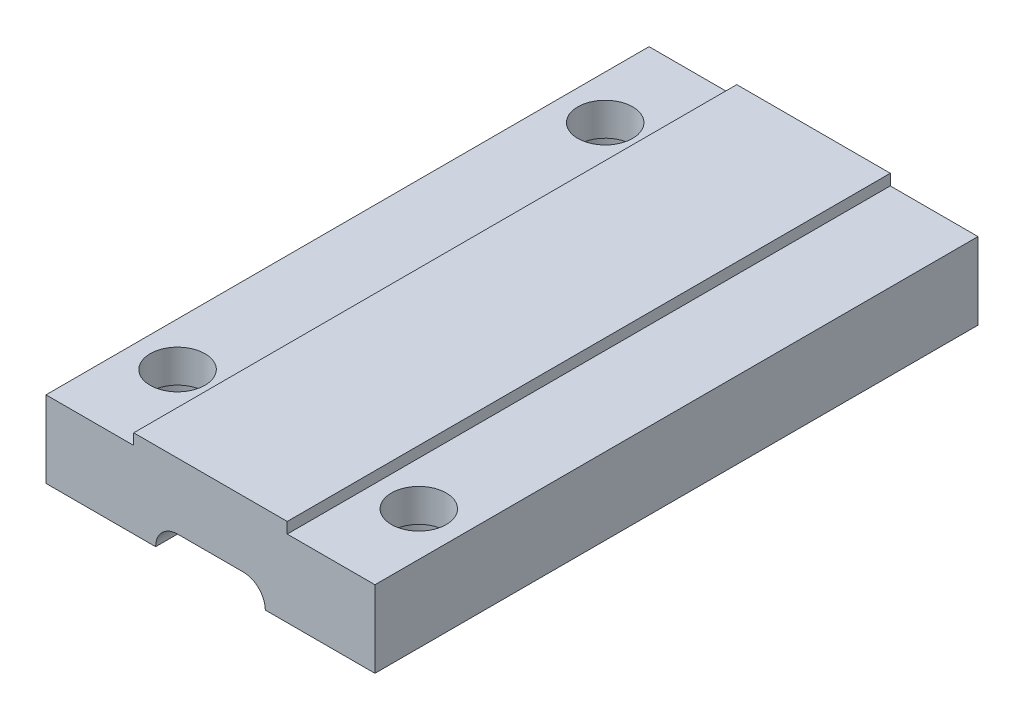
ISO-10303-21;
HEADER;
FILE_DESCRIPTION(('STEP AP214'),'2;1');
FILE_NAME('part.step','',(''),(''),'','','');
FILE_SCHEMA(('AUTOMOTIVE_DESIGN { 1 0 10303 214 1 1 1 1 }'));
ENDSEC;
DATA;
#1=APPLICATION_CONTEXT('core data for automotive mechanical design processes');
#2=APPLICATION_PROTOCOL_DEFINITION('international standard','automotive_design',2000,#1);
#3=PRODUCT_CONTEXT('',#1,'mechanical');
#4=PRODUCT('Part','Part','',(#3));
#5=PRODUCT_RELATED_PRODUCT_CATEGORY('part','',(#4));
#6=PRODUCT_DEFINITION_FORMATION('','',#4);
#7=PRODUCT_DEFINITION_CONTEXT('part definition',#1,'design');
#8=PRODUCT_DEFINITION('design','',#6,#7);
#9=PRODUCT_DEFINITION_SHAPE('','',#8);
#10=(LENGTH_UNIT() NAMED_UNIT(*) SI_UNIT(.MILLI.,.METRE.));
#11=(NAMED_UNIT(*) PLANE_ANGLE_UNIT() SI_UNIT($,.RADIAN.));
#12=(NAMED_UNIT(*) SI_UNIT($,.STERADIAN.) SOLID_ANGLE_UNIT());
#13=UNCERTAINTY_MEASURE_WITH_UNIT(LENGTH_MEASURE(1.E-05),#10,'distance_accuracy_value','');
#14=(GEOMETRIC_REPRESENTATION_CONTEXT(3) GLOBAL_UNCERTAINTY_ASSIGNED_CONTEXT((#13)) GLOBAL_UNIT_ASSIGNED_CONTEXT((#10,
#11,#12)) REPRESENTATION_CONTEXT('',''));
#15=CARTESIAN_POINT('',(0.,0.,0.));
#16=DIRECTION('',(0.,0.,1.));
#17=DIRECTION('',(1.,0.,0.));
#18=AXIS2_PLACEMENT_3D('',#15,#16,#17);
#19=CARTESIAN_POINT('',(0.,0.,110.));
#20=DIRECTION('',(1.,0.,0.));
#21=DIRECTION('',(0.,0.,-1.));
#22=AXIS2_PLACEMENT_3D('',#19,#20,#21);
#23=PLANE('',#22);
#24=DIRECTION('',(0.,-1.,0.));
#25=VECTOR('',#24,1.);
#26=CARTESIAN_POINT('',(0.,0.,0.));
#27=LINE('',#26,#25);
#28=CARTESIAN_POINT('',(0.,14.,0.));
#29=VERTEX_POINT('',#28);
#30=CARTESIAN_POINT('',(0.,0.,0.));
#31=VERTEX_POINT('',#30);
#32=EDGE_CURVE('E127',#29,#31,#27,.T.);
#33=ORIENTED_EDGE('',*,*,#32,.T.);
#34=DIRECTION('',(0.,0.,-1.));
#35=VECTOR('',#34,1.);
#36=CARTESIAN_POINT('',(0.,0.,110.));
#37=LINE('',#36,#35);
#38=CARTESIAN_POINT('',(0.,0.,110.));
#39=VERTEX_POINT('',#38);
#40=EDGE_CURVE('E134',#39,#31,#37,.T.);
#41=ORIENTED_EDGE('',*,*,#40,.F.);
#42=DIRECTION('',(0.,-1.,0.));
#43=VECTOR('',#42,1.);
#44=CARTESIAN_POINT('',(0.,0.,110.));
#45=LINE('',#44,#43);
#46=CARTESIAN_POINT('',(0.,14.,110.));
#47=VERTEX_POINT('',#46);
#48=EDGE_CURVE('E169',#47,#39,#45,.T.);
#49=ORIENTED_EDGE('',*,*,#48,.F.);
#50=DIRECTION('',(0.,0.,-1.));
#51=VECTOR('',#50,1.);
#52=CARTESIAN_POINT('',(0.,14.,110.));
#53=LINE('',#52,#51);
#54=EDGE_CURVE('E145',#47,#29,#53,.T.);
#55=ORIENTED_EDGE('',*,*,#54,.T.);
#56=EDGE_LOOP('',(#33,#41,#49,#55));
#57=FACE_BOUND('',#56,.T.);
#58=ADVANCED_FACE('F34',(#57),#23,.F.);
#59=CARTESIAN_POINT('',(0.,0.,110.));
#60=DIRECTION('',(0.,1.,0.));
#61=DIRECTION('',(0.,0.,1.));
#62=AXIS2_PLACEMENT_3D('',#59,#60,#61);
#63=PLANE('',#62);
#64=CARTESIAN_POINT('',(8.,0.,16.));
#65=DIRECTION('',(0.,-1.,0.));
#66=DIRECTION('',(0.,0.,-1.));
#67=AXIS2_PLACEMENT_3D('',#64,#65,#66);
#68=CIRCLE('',#67,7.00000000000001);
#69=CARTESIAN_POINT('',(8.,0.,8.99999999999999));
#70=VERTEX_POINT('',#69);
#71=EDGE_CURVE('E481',#70,#70,#68,.T.);
#72=ORIENTED_EDGE('',*,*,#71,.F.);
#73=EDGE_LOOP('',(#72));
#74=FACE_BOUND('',#73,.T.);
#75=CARTESIAN_POINT('',(8.00000000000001,0.,94.));
#76=DIRECTION('',(0.,-1.,0.));
#77=DIRECTION('',(0.,0.,-1.));
#78=AXIS2_PLACEMENT_3D('',#75,#76,#77);
#79=CIRCLE('',#78,7.00000000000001);
#80=CARTESIAN_POINT('',(8.00000000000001,0.,87.));
#81=VERTEX_POINT('',#80);
#82=EDGE_CURVE('E223',#81,#81,#79,.T.);
#83=ORIENTED_EDGE('',*,*,#82,.F.);
#84=EDGE_LOOP('',(#83));
#85=FACE_BOUND('',#84,.T.);
#86=DIRECTION('',(1.,0.,0.));
#87=VECTOR('',#86,1.);
#88=CARTESIAN_POINT('',(0.,0.,0.));
#89=LINE('',#88,#87);
#90=CARTESIAN_POINT('',(20.,0.,0.));
#91=VERTEX_POINT('',#90);
#92=EDGE_CURVE('E122',#31,#91,#89,.T.);
#93=ORIENTED_EDGE('',*,*,#92,.T.);
#94=DIRECTION('',(0.,0.,-1.));
#95=VECTOR('',#94,1.);
#96=CARTESIAN_POINT('',(20.,0.,110.));
#97=LINE('',#96,#95);
#98=CARTESIAN_POINT('',(20.,0.,110.));
#99=VERTEX_POINT('',#98);
#100=EDGE_CURVE('E141',#99,#91,#97,.T.);
#101=ORIENTED_EDGE('',*,*,#100,.F.);
#102=DIRECTION('',(1.,0.,0.));
#103=VECTOR('',#102,1.);
#104=CARTESIAN_POINT('',(0.,0.,110.));
#105=LINE('',#104,#103);
#106=EDGE_CURVE('E136',#39,#99,#105,.T.);
#107=ORIENTED_EDGE('',*,*,#106,.F.);
#108=ORIENTED_EDGE('',*,*,#40,.T.);
#109=EDGE_LOOP('',(#93,#101,#107,#108));
#110=FACE_BOUND('',#109,.T.);
#111=ADVANCED_FACE('F135',(#74,#85,#110),#63,.F.);
#112=CARTESIAN_POINT('',(20.,4.,110.));
#113=DIRECTION('',(0.,1.,0.));
#114=DIRECTION('',(0.,0.,1.));
#115=AXIS2_PLACEMENT_3D('',#112,#113,#114);
#116=PLANE('',#115);
#117=DIRECTION('',(1.,0.,0.));
#118=VECTOR('',#117,1.);
#119=CARTESIAN_POINT('',(20.,4.,110.));
#120=LINE('',#119,#118);
#121=CARTESIAN_POINT('',(24.,4.,110.));
#122=VERTEX_POINT('',#121);
#123=CARTESIAN_POINT('',(36.,4.,110.));
#124=VERTEX_POINT('',#123);
#125=EDGE_CURVE('E172',#122,#124,#120,.T.);
#126=ORIENTED_EDGE('',*,*,#125,.F.);
#127=DIRECTION('',(0.,0.,-1.));
#128=VECTOR('',#127,1.);
#129=CARTESIAN_POINT('',(24.,4.,0.));
#130=LINE('',#129,#128);
#131=CARTESIAN_POINT('',(24.,4.,0.));
#132=VERTEX_POINT('',#131);
#133=EDGE_CURVE('E218',#122,#132,#130,.T.);
#134=ORIENTED_EDGE('',*,*,#133,.T.);
#135=DIRECTION('',(1.,0.,0.));
#136=VECTOR('',#135,1.);
#137=CARTESIAN_POINT('',(20.,4.,0.));
#138=LINE('',#137,#136);
#139=CARTESIAN_POINT('',(36.,4.,0.));
#140=VERTEX_POINT('',#139);
#141=EDGE_CURVE('E131',#132,#140,#138,.T.);
#142=ORIENTED_EDGE('',*,*,#141,.T.);
#143=DIRECTION('',(0.,0.,-1.));
#144=VECTOR('',#143,1.);
#145=CARTESIAN_POINT('',(36.,4.,110.));
#146=LINE('',#145,#144);
#147=EDGE_CURVE('E140',#140,#124,#146,.F.);
#148=ORIENTED_EDGE('',*,*,#147,.T.);
#149=EDGE_LOOP('',(#126,#134,#142,#148));
#150=FACE_BOUND('',#149,.T.);
#151=ADVANCED_FACE('F250',(#150),#116,.F.);
#152=CARTESIAN_POINT('',(40.,0.,110.));
#153=DIRECTION('',(0.,1.,0.));
#154=DIRECTION('',(0.,0.,1.));
#155=AXIS2_PLACEMENT_3D('',#152,#153,#154);
#156=PLANE('',#155);
#157=CARTESIAN_POINT('',(52.,0.,94.));
#158=DIRECTION('',(0.,-1.,0.));
#159=DIRECTION('',(0.,0.,-1.));
#160=AXIS2_PLACEMENT_3D('',#157,#158,#159);
#161=CIRCLE('',#160,7.00000000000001);
#162=CARTESIAN_POINT('',(52.,0.,87.));
#163=VERTEX_POINT('',#162);
#164=EDGE_CURVE('E149',#163,#163,#161,.T.);
#165=ORIENTED_EDGE('',*,*,#164,.F.);
#166=EDGE_LOOP('',(#165));
#167=FACE_BOUND('',#166,.T.);
#168=DIRECTION('',(1.,0.,0.));
#169=VECTOR('',#168,1.);
#170=CARTESIAN_POINT('',(40.,0.,0.));
#171=LINE('',#170,#169);
#172=CARTESIAN_POINT('',(40.,0.,0.));
#173=VERTEX_POINT('',#172);
#174=CARTESIAN_POINT('',(60.,0.,0.));
#175=VERTEX_POINT('',#174);
#176=EDGE_CURVE('E155',#173,#175,#171,.T.);
#177=ORIENTED_EDGE('',*,*,#176,.T.);
#178=DIRECTION('',(0.,0.,-1.));
#179=VECTOR('',#178,1.);
#180=CARTESIAN_POINT('',(60.,0.,110.));
#181=LINE('',#180,#179);
#182=CARTESIAN_POINT('',(60.,0.,110.));
#183=VERTEX_POINT('',#182);
#184=EDGE_CURVE('E204',#183,#175,#181,.T.);
#185=ORIENTED_EDGE('',*,*,#184,.F.);
#186=DIRECTION('',(1.,0.,0.));
#187=VECTOR('',#186,1.);
#188=CARTESIAN_POINT('',(40.,0.,110.));
#189=LINE('',#188,#187);
#190=CARTESIAN_POINT('',(40.,0.,110.));
#191=VERTEX_POINT('',#190);
#192=EDGE_CURVE('E174',#191,#183,#189,.T.);
#193=ORIENTED_EDGE('',*,*,#192,.F.);
#194=DIRECTION('',(0.,0.,-1.));
#195=VECTOR('',#194,1.);
#196=CARTESIAN_POINT('',(40.,0.,110.));
#197=LINE('',#196,#195);
#198=EDGE_CURVE('E207',#191,#173,#197,.T.);
#199=ORIENTED_EDGE('',*,*,#198,.T.);
#200=EDGE_LOOP('',(#177,#185,#193,#199));
#201=FACE_BOUND('',#200,.T.);
#202=ADVANCED_FACE('F246',(#167,#201),#156,.F.);
#203=CARTESIAN_POINT('',(60.,0.,110.));
#204=DIRECTION('',(-1.,0.,0.));
#205=DIRECTION('',(0.,0.,1.));
#206=AXIS2_PLACEMENT_3D('',#203,#204,#205);
#207=PLANE('',#206);
#208=DIRECTION('',(0.,1.,0.));
#209=VECTOR('',#208,1.);
#210=CARTESIAN_POINT('',(60.,0.,0.));
#211=LINE('',#210,#209);
#212=CARTESIAN_POINT('',(60.,14.,0.));
#213=VERTEX_POINT('',#212);
#214=EDGE_CURVE('E157',#175,#213,#211,.T.);
#215=ORIENTED_EDGE('',*,*,#214,.T.);
#216=DIRECTION('',(0.,0.,-1.));
#217=VECTOR('',#216,1.);
#218=CARTESIAN_POINT('',(60.,14.,110.));
#219=LINE('',#218,#217);
#220=CARTESIAN_POINT('',(60.,14.,110.));
#221=VERTEX_POINT('',#220);
#222=EDGE_CURVE('E201',#221,#213,#219,.T.);
#223=ORIENTED_EDGE('',*,*,#222,.F.);
#224=DIRECTION('',(0.,1.,0.));
#225=VECTOR('',#224,1.);
#226=CARTESIAN_POINT('',(60.,0.,110.));
#227=LINE('',#226,#225);
#228=EDGE_CURVE('E176',#183,#221,#227,.T.);
#229=ORIENTED_EDGE('',*,*,#228,.F.);
#230=ORIENTED_EDGE('',*,*,#184,.T.);
#231=EDGE_LOOP('',(#215,#223,#229,#230));
#232=FACE_BOUND('',#231,.T.);
#233=ADVANCED_FACE('F249',(#232),#207,.F.);
#234=CARTESIAN_POINT('',(44.,14.,110.));
#235=DIRECTION('',(0.,-1.,0.));
#236=DIRECTION('',(0.,0.,-1.));
#237=AXIS2_PLACEMENT_3D('',#234,#235,#236);
#238=PLANE('',#237);
#239=CARTESIAN_POINT('',(52.,14.,94.));
#240=DIRECTION('',(0.,-1.,0.));
#241=DIRECTION('',(0.,0.,-1.));
#242=AXIS2_PLACEMENT_3D('',#239,#240,#241);
#243=CIRCLE('',#242,5.00000000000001);
#244=CARTESIAN_POINT('',(52.,14.,89.));
#245=VERTEX_POINT('',#244);
#246=EDGE_CURVE('E146',#245,#245,#243,.T.);
#247=ORIENTED_EDGE('',*,*,#246,.T.);
#248=EDGE_LOOP('',(#247));
#249=FACE_BOUND('',#248,.T.);
#250=DIRECTION('',(-1.,0.,0.));
#251=VECTOR('',#250,1.);
#252=CARTESIAN_POINT('',(44.,14.,0.));
#253=LINE('',#252,#251);
#254=CARTESIAN_POINT('',(44.,14.,0.));
#255=VERTEX_POINT('',#254);
#256=EDGE_CURVE('E159',#213,#255,#253,.T.);
#257=ORIENTED_EDGE('',*,*,#256,.T.);
#258=DIRECTION('',(0.,0.,-1.));
#259=VECTOR('',#258,1.);
#260=CARTESIAN_POINT('',(44.,14.,110.));
#261=LINE('',#260,#259);
#262=CARTESIAN_POINT('',(44.,14.,110.));
#263=VERTEX_POINT('',#262);
#264=EDGE_CURVE('E198',#263,#255,#261,.T.);
#265=ORIENTED_EDGE('',*,*,#264,.F.);
#266=DIRECTION('',(-1.,0.,0.));
#267=VECTOR('',#266,1.);
#268=CARTESIAN_POINT('',(44.,14.,110.));
#269=LINE('',#268,#267);
#270=EDGE_CURVE('E178',#221,#263,#269,.T.);
#271=ORIENTED_EDGE('',*,*,#270,.F.);
#272=ORIENTED_EDGE('',*,*,#222,.T.);
#273=EDGE_LOOP('',(#257,#265,#271,#272));
#274=FACE_BOUND('',#273,.T.);
#275=ADVANCED_FACE('F265',(#249,#274),#238,.F.);
#276=CARTESIAN_POINT('',(44.,16.,110.));
#277=DIRECTION('',(-1.,0.,0.));
#278=DIRECTION('',(0.,0.,1.));
#279=AXIS2_PLACEMENT_3D('',#276,#277,#278);
#280=PLANE('',#279);
#281=DIRECTION('',(0.,1.,0.));
#282=VECTOR('',#281,1.);
#283=CARTESIAN_POINT('',(44.,16.,0.));
#284=LINE('',#283,#282);
#285=CARTESIAN_POINT('',(44.,16.,0.));
#286=VERTEX_POINT('',#285);
#287=EDGE_CURVE('E161',#255,#286,#284,.T.);
#288=ORIENTED_EDGE('',*,*,#287,.T.);
#289=DIRECTION('',(0.,0.,-1.));
#290=VECTOR('',#289,1.);
#291=CARTESIAN_POINT('',(44.,16.,110.));
#292=LINE('',#291,#290);
#293=CARTESIAN_POINT('',(44.,16.,110.));
#294=VERTEX_POINT('',#293);
#295=EDGE_CURVE('E195',#294,#286,#292,.T.);
#296=ORIENTED_EDGE('',*,*,#295,.F.);
#297=DIRECTION('',(0.,1.,0.));
#298=VECTOR('',#297,1.);
#299=CARTESIAN_POINT('',(44.,16.,110.));
#300=LINE('',#299,#298);
#301=EDGE_CURVE('E180',#263,#294,#300,.T.);
#302=ORIENTED_EDGE('',*,*,#301,.F.);
#303=ORIENTED_EDGE('',*,*,#264,.T.);
#304=EDGE_LOOP('',(#288,#296,#302,#303));
#305=FACE_BOUND('',#304,.T.);
#306=ADVANCED_FACE('F269',(#305),#280,.F.);
#307=CARTESIAN_POINT('',(16.,16.,110.));
#308=DIRECTION('',(0.,-1.,0.));
#309=DIRECTION('',(0.,0.,-1.));
#310=AXIS2_PLACEMENT_3D('',#307,#308,#309);
#311=PLANE('',#310);
#312=DIRECTION('',(-1.,0.,0.));
#313=VECTOR('',#312,1.);
#314=CARTESIAN_POINT('',(16.,16.,0.));
#315=LINE('',#314,#313);
#316=CARTESIAN_POINT('',(16.,16.,0.));
#317=VERTEX_POINT('',#316);
#318=EDGE_CURVE('E163',#286,#317,#315,.T.);
#319=ORIENTED_EDGE('',*,*,#318,.T.);
#320=DIRECTION('',(0.,0.,-1.));
#321=VECTOR('',#320,1.);
#322=CARTESIAN_POINT('',(16.,16.,110.));
#323=LINE('',#322,#321);
#324=CARTESIAN_POINT('',(16.,16.,110.));
#325=VERTEX_POINT('',#324);
#326=EDGE_CURVE('E192',#325,#317,#323,.T.);
#327=ORIENTED_EDGE('',*,*,#326,.F.);
#328=DIRECTION('',(-1.,0.,0.));
#329=VECTOR('',#328,1.);
#330=CARTESIAN_POINT('',(16.,16.,110.));
#331=LINE('',#330,#329);
#332=EDGE_CURVE('E182',#294,#325,#331,.T.);
#333=ORIENTED_EDGE('',*,*,#332,.F.);
#334=ORIENTED_EDGE('',*,*,#295,.T.);
#335=EDGE_LOOP('',(#319,#327,#333,#334));
#336=FACE_BOUND('',#335,.T.);
#337=ADVANCED_FACE('F310',(#336),#311,.F.);
#338=CARTESIAN_POINT('',(16.,14.,110.));
#339=DIRECTION('',(1.,0.,0.));
#340=DIRECTION('',(0.,0.,-1.));
#341=AXIS2_PLACEMENT_3D('',#338,#339,#340);
#342=PLANE('',#341);
#343=DIRECTION('',(0.,-1.,0.));
#344=VECTOR('',#343,1.);
#345=CARTESIAN_POINT('',(16.,14.,0.));
#346=LINE('',#345,#344);
#347=CARTESIAN_POINT('',(16.,14.,0.));
#348=VERTEX_POINT('',#347);
#349=EDGE_CURVE('E165',#317,#348,#346,.T.);
#350=ORIENTED_EDGE('',*,*,#349,.T.);
#351=DIRECTION('',(0.,0.,-1.));
#352=VECTOR('',#351,1.);
#353=CARTESIAN_POINT('',(16.,14.,110.));
#354=LINE('',#353,#352);
#355=CARTESIAN_POINT('',(16.,14.,110.));
#356=VERTEX_POINT('',#355);
#357=EDGE_CURVE('E189',#356,#348,#354,.T.);
#358=ORIENTED_EDGE('',*,*,#357,.F.);
#359=DIRECTION('',(0.,-1.,0.));
#360=VECTOR('',#359,1.);
#361=CARTESIAN_POINT('',(16.,14.,110.));
#362=LINE('',#361,#360);
#363=EDGE_CURVE('E184',#325,#356,#362,.T.);
#364=ORIENTED_EDGE('',*,*,#363,.F.);
#365=ORIENTED_EDGE('',*,*,#326,.T.);
#366=EDGE_LOOP('',(#350,#358,#364,#365));
#367=FACE_BOUND('',#366,.T.);
#368=ADVANCED_FACE('F313',(#367),#342,.F.);
#369=CARTESIAN_POINT('',(0.,14.,110.));
#370=DIRECTION('',(0.,-1.,0.));
#371=DIRECTION('',(0.,0.,-1.));
#372=AXIS2_PLACEMENT_3D('',#369,#370,#371);
#373=PLANE('',#372);
#374=CARTESIAN_POINT('',(8.,14.,16.));
#375=DIRECTION('',(0.,-1.,0.));
#376=DIRECTION('',(0.,0.,-1.));
#377=AXIS2_PLACEMENT_3D('',#374,#375,#376);
#378=CIRCLE('',#377,5.00000000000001);
#379=CARTESIAN_POINT('',(8.,14.,11.));
#380=VERTEX_POINT('',#379);
#381=EDGE_CURVE('E37',#380,#380,#378,.T.);
#382=ORIENTED_EDGE('',*,*,#381,.T.);
#383=EDGE_LOOP('',(#382));
#384=FACE_BOUND('',#383,.T.);
#385=CARTESIAN_POINT('',(8.00000000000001,14.,94.));
#386=DIRECTION('',(0.,-1.,0.));
#387=DIRECTION('',(0.,0.,-1.));
#388=AXIS2_PLACEMENT_3D('',#385,#386,#387);
#389=CIRCLE('',#388,5.00000000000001);
#390=CARTESIAN_POINT('',(8.00000000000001,14.,89.));
#391=VERTEX_POINT('',#390);
#392=EDGE_CURVE('E220',#391,#391,#389,.T.);
#393=ORIENTED_EDGE('',*,*,#392,.T.);
#394=EDGE_LOOP('',(#393));
#395=FACE_BOUND('',#394,.T.);
#396=DIRECTION('',(-1.,0.,0.));
#397=VECTOR('',#396,1.);
#398=CARTESIAN_POINT('',(0.,14.,0.));
#399=LINE('',#398,#397);
#400=EDGE_CURVE('E167',#348,#29,#399,.T.);
#401=ORIENTED_EDGE('',*,*,#400,.T.);
#402=ORIENTED_EDGE('',*,*,#54,.F.);
#403=DIRECTION('',(-1.,0.,0.));
#404=VECTOR('',#403,1.);
#405=CARTESIAN_POINT('',(0.,14.,110.));
#406=LINE('',#405,#404);
#407=EDGE_CURVE('E186',#356,#47,#406,.T.);
#408=ORIENTED_EDGE('',*,*,#407,.F.);
#409=ORIENTED_EDGE('',*,*,#357,.T.);
#410=EDGE_LOOP('',(#401,#402,#408,#409));
#411=FACE_BOUND('',#410,.T.);
#412=ADVANCED_FACE('F317',(#384,#395,#411),#373,.F.);
#413=CARTESIAN_POINT('',(0.,14.,110.));
#414=DIRECTION('',(0.,0.,-1.));
#415=DIRECTION('',(-1.,0.,0.));
#416=AXIS2_PLACEMENT_3D('',#413,#414,#415);
#417=PLANE('',#416);
#418=ORIENTED_EDGE('',*,*,#48,.T.);
#419=ORIENTED_EDGE('',*,*,#106,.T.);
#420=CARTESIAN_POINT('',(24.,0.,110.));
#421=DIRECTION('',(0.,0.,-1.));
#422=DIRECTION('',(-1.,0.,0.));
#423=AXIS2_PLACEMENT_3D('',#420,#421,#422);
#424=CIRCLE('',#423,4.);
#425=EDGE_CURVE('E11',#99,#122,#424,.T.);
#426=ORIENTED_EDGE('',*,*,#425,.T.);
#427=ORIENTED_EDGE('',*,*,#125,.T.);
#428=CARTESIAN_POINT('',(36.,0.,110.));
#429=DIRECTION('',(0.,0.,-1.));
#430=DIRECTION('',(-1.,0.,0.));
#431=AXIS2_PLACEMENT_3D('',#428,#429,#430);
#432=CIRCLE('',#431,4.);
#433=EDGE_CURVE('E216',#124,#191,#432,.T.);
#434=ORIENTED_EDGE('',*,*,#433,.T.);
#435=ORIENTED_EDGE('',*,*,#192,.T.);
#436=ORIENTED_EDGE('',*,*,#228,.T.);
#437=ORIENTED_EDGE('',*,*,#270,.T.);
#438=ORIENTED_EDGE('',*,*,#301,.T.);
#439=ORIENTED_EDGE('',*,*,#332,.T.);
#440=ORIENTED_EDGE('',*,*,#363,.T.);
#441=ORIENTED_EDGE('',*,*,#407,.T.);
#442=EDGE_LOOP('',(#418,#419,#426,#427,#434,#435,#436,#437,#438,#439,#440,#441));
#443=FACE_BOUND('',#442,.T.);
#444=ADVANCED_FACE('F272',(#443),#417,.F.);
#445=CARTESIAN_POINT('',(0.,14.,0.));
#446=DIRECTION('',(0.,0.,-1.));
#447=DIRECTION('',(-1.,0.,0.));
#448=AXIS2_PLACEMENT_3D('',#445,#446,#447);
#449=PLANE('',#448);
#450=ORIENTED_EDGE('',*,*,#32,.F.);
#451=ORIENTED_EDGE('',*,*,#400,.F.);
#452=ORIENTED_EDGE('',*,*,#349,.F.);
#453=ORIENTED_EDGE('',*,*,#318,.F.);
#454=ORIENTED_EDGE('',*,*,#287,.F.);
#455=ORIENTED_EDGE('',*,*,#256,.F.);
#456=ORIENTED_EDGE('',*,*,#214,.F.);
#457=ORIENTED_EDGE('',*,*,#176,.F.);
#458=CARTESIAN_POINT('',(36.,0.,0.));
#459=DIRECTION('',(0.,0.,-1.));
#460=DIRECTION('',(-1.,0.,0.));
#461=AXIS2_PLACEMENT_3D('',#458,#459,#460);
#462=CIRCLE('',#461,4.);
#463=EDGE_CURVE('E213',#173,#140,#462,.F.);
#464=ORIENTED_EDGE('',*,*,#463,.T.);
#465=ORIENTED_EDGE('',*,*,#141,.F.);
#466=CARTESIAN_POINT('',(24.,0.,0.));
#467=DIRECTION('',(0.,0.,-1.));
#468=DIRECTION('',(-1.,0.,0.));
#469=AXIS2_PLACEMENT_3D('',#466,#467,#468);
#470=CIRCLE('',#469,4.);
#471=EDGE_CURVE('E42',#132,#91,#470,.F.);
#472=ORIENTED_EDGE('',*,*,#471,.T.);
#473=ORIENTED_EDGE('',*,*,#92,.F.);
#474=EDGE_LOOP('',(#450,#451,#452,#453,#454,#455,#456,#457,#464,#465,#472,#473));
#475=FACE_BOUND('',#474,.T.);
#476=ADVANCED_FACE('F124',(#475),#449,.T.);
#477=CARTESIAN_POINT('',(36.,0.,110.));
#478=DIRECTION('',(0.,0.,1.));
#479=DIRECTION('',(1.,0.,0.));
#480=AXIS2_PLACEMENT_3D('',#477,#478,#479);
#481=CYLINDRICAL_SURFACE('',#480,4.);
#482=ORIENTED_EDGE('',*,*,#433,.F.);
#483=ORIENTED_EDGE('',*,*,#147,.F.);
#484=ORIENTED_EDGE('',*,*,#463,.F.);
#485=ORIENTED_EDGE('',*,*,#198,.F.);
#486=EDGE_LOOP('',(#482,#483,#484,#485));
#487=FACE_BOUND('',#486,.T.);
#488=ADVANCED_FACE('F276',(#487),#481,.F.);
#489=CARTESIAN_POINT('',(24.,0.,110.));
#490=DIRECTION('',(0.,0.,1.));
#491=DIRECTION('',(1.,0.,0.));
#492=AXIS2_PLACEMENT_3D('',#489,#490,#491);
#493=CYLINDRICAL_SURFACE('',#492,4.);
#494=ORIENTED_EDGE('',*,*,#425,.F.);
#495=ORIENTED_EDGE('',*,*,#100,.T.);
#496=ORIENTED_EDGE('',*,*,#471,.F.);
#497=ORIENTED_EDGE('',*,*,#133,.F.);
#498=EDGE_LOOP('',(#494,#495,#496,#497));
#499=FACE_BOUND('',#498,.T.);
#500=ADVANCED_FACE('F279',(#499),#493,.F.);
#501=CARTESIAN_POINT('',(52.,0.,94.));
#502=DIRECTION('',(0.,-1.,0.));
#503=DIRECTION('',(0.,0.,-1.));
#504=AXIS2_PLACEMENT_3D('',#501,#502,#503);
#505=CYLINDRICAL_SURFACE('',#504,5.00000000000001);
#506=CARTESIAN_POINT('',(52.,8.,94.));
#507=DIRECTION('',(0.,-1.,0.));
#508=DIRECTION('',(0.,0.,-1.));
#509=AXIS2_PLACEMENT_3D('',#506,#507,#508);
#510=CIRCLE('',#509,5.00000000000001);
#511=CARTESIAN_POINT('',(52.,8.,89.));
#512=VERTEX_POINT('',#511);
#513=EDGE_CURVE('E222',#512,#512,#510,.T.);
#514=ORIENTED_EDGE('',*,*,#513,.T.);
#515=EDGE_LOOP('',(#514));
#516=FACE_BOUND('',#515,.T.);
#517=ORIENTED_EDGE('',*,*,#246,.F.);
#518=EDGE_LOOP('',(#517));
#519=FACE_BOUND('',#518,.T.);
#520=ADVANCED_FACE('F281',(#516,#519),#505,.F.);
#521=CARTESIAN_POINT('',(52.,0.,94.));
#522=DIRECTION('',(0.,-1.,0.));
#523=DIRECTION('',(0.,0.,-1.));
#524=AXIS2_PLACEMENT_3D('',#521,#522,#523);
#525=CYLINDRICAL_SURFACE('',#524,7.00000000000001);
#526=CARTESIAN_POINT('',(52.,8.,94.));
#527=DIRECTION('',(0.,-1.,0.));
#528=DIRECTION('',(0.,0.,-1.));
#529=AXIS2_PLACEMENT_3D('',#526,#527,#528);
#530=CIRCLE('',#529,7.00000000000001);
#531=CARTESIAN_POINT('',(52.,8.,87.));
#532=VERTEX_POINT('',#531);
#533=EDGE_CURVE('E227',#532,#532,#530,.T.);
#534=ORIENTED_EDGE('',*,*,#533,.F.);
#535=EDGE_LOOP('',(#534));
#536=FACE_BOUND('',#535,.T.);
#537=ORIENTED_EDGE('',*,*,#164,.T.);
#538=EDGE_LOOP('',(#537));
#539=FACE_BOUND('',#538,.T.);
#540=ADVANCED_FACE('F244',(#536,#539),#525,.F.);
#541=CARTESIAN_POINT('',(57.,8.,94.));
#542=DIRECTION('',(0.,1.,0.));
#543=DIRECTION('',(0.,0.,1.));
#544=AXIS2_PLACEMENT_3D('',#541,#542,#543);
#545=PLANE('',#544);
#546=ORIENTED_EDGE('',*,*,#513,.F.);
#547=EDGE_LOOP('',(#546));
#548=FACE_BOUND('',#547,.T.);
#549=ORIENTED_EDGE('',*,*,#533,.T.);
#550=EDGE_LOOP('',(#549));
#551=FACE_BOUND('',#550,.T.);
#552=ADVANCED_FACE('F402',(#548,#551),#545,.F.);
#553=CARTESIAN_POINT('',(8.00000000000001,0.,94.));
#554=DIRECTION('',(0.,-1.,0.));
#555=DIRECTION('',(0.,0.,-1.));
#556=AXIS2_PLACEMENT_3D('',#553,#554,#555);
#557=CYLINDRICAL_SURFACE('',#556,5.00000000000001);
#558=CARTESIAN_POINT('',(8.00000000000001,8.,94.));
#559=DIRECTION('',(0.,-1.,0.));
#560=DIRECTION('',(0.,0.,-1.));
#561=AXIS2_PLACEMENT_3D('',#558,#559,#560);
#562=CIRCLE('',#561,5.00000000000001);
#563=CARTESIAN_POINT('',(8.00000000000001,8.,89.));
#564=VERTEX_POINT('',#563);
#565=EDGE_CURVE('E235',#564,#564,#562,.T.);
#566=ORIENTED_EDGE('',*,*,#565,.T.);
#567=EDGE_LOOP('',(#566));
#568=FACE_BOUND('',#567,.T.);
#569=ORIENTED_EDGE('',*,*,#392,.F.);
#570=EDGE_LOOP('',(#569));
#571=FACE_BOUND('',#570,.T.);
#572=ADVANCED_FACE('F410',(#568,#571),#557,.F.);
#573=CARTESIAN_POINT('',(8.00000000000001,0.,94.));
#574=DIRECTION('',(0.,-1.,0.));
#575=DIRECTION('',(0.,0.,-1.));
#576=AXIS2_PLACEMENT_3D('',#573,#574,#575);
#577=CYLINDRICAL_SURFACE('',#576,7.00000000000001);
#578=CARTESIAN_POINT('',(8.00000000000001,8.,94.));
#579=DIRECTION('',(0.,-1.,0.));
#580=DIRECTION('',(0.,0.,-1.));
#581=AXIS2_PLACEMENT_3D('',#578,#579,#580);
#582=CIRCLE('',#581,7.00000000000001);
#583=CARTESIAN_POINT('',(8.00000000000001,8.,87.));
#584=VERTEX_POINT('',#583);
#585=EDGE_CURVE('E230',#584,#584,#582,.T.);
#586=ORIENTED_EDGE('',*,*,#585,.F.);
#587=EDGE_LOOP('',(#586));
#588=FACE_BOUND('',#587,.T.);
#589=ORIENTED_EDGE('',*,*,#82,.T.);
#590=EDGE_LOOP('',(#589));
#591=FACE_BOUND('',#590,.T.);
#592=ADVANCED_FACE('F419',(#588,#591),#577,.F.);
#593=CARTESIAN_POINT('',(13.,8.,94.));
#594=DIRECTION('',(0.,1.,0.));
#595=DIRECTION('',(0.,0.,1.));
#596=AXIS2_PLACEMENT_3D('',#593,#594,#595);
#597=PLANE('',#596);
#598=ORIENTED_EDGE('',*,*,#565,.F.);
#599=EDGE_LOOP('',(#598));
#600=FACE_BOUND('',#599,.T.);
#601=ORIENTED_EDGE('',*,*,#585,.T.);
#602=EDGE_LOOP('',(#601));
#603=FACE_BOUND('',#602,.T.);
#604=ADVANCED_FACE('F428',(#600,#603),#597,.F.);
#605=CARTESIAN_POINT('',(8.,0.,16.));
#606=DIRECTION('',(0.,-1.,0.));
#607=DIRECTION('',(0.,0.,-1.));
#608=AXIS2_PLACEMENT_3D('',#605,#606,#607);
#609=CYLINDRICAL_SURFACE('',#608,5.00000000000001);
#610=CARTESIAN_POINT('',(8.,8.,16.));
#611=DIRECTION('',(0.,-1.,0.));
#612=DIRECTION('',(0.,0.,-1.));
#613=AXIS2_PLACEMENT_3D('',#610,#611,#612);
#614=CIRCLE('',#613,5.00000000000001);
#615=CARTESIAN_POINT('',(8.,8.,11.));
#616=VERTEX_POINT('',#615);
#617=EDGE_CURVE('E477',#616,#616,#614,.T.);
#618=ORIENTED_EDGE('',*,*,#617,.T.);
#619=EDGE_LOOP('',(#618));
#620=FACE_BOUND('',#619,.T.);
#621=ORIENTED_EDGE('',*,*,#381,.F.);
#622=EDGE_LOOP('',(#621));
#623=FACE_BOUND('',#622,.T.);
#624=ADVANCED_FACE('F437',(#620,#623),#609,.F.);
#625=CARTESIAN_POINT('',(8.,0.,16.));
#626=DIRECTION('',(0.,-1.,0.));
#627=DIRECTION('',(0.,0.,-1.));
#628=AXIS2_PLACEMENT_3D('',#625,#626,#627);
#629=CYLINDRICAL_SURFACE('',#628,7.00000000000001);
#630=CARTESIAN_POINT('',(8.,8.,16.));
#631=DIRECTION('',(0.,-1.,0.));
#632=DIRECTION('',(0.,0.,-1.));
#633=AXIS2_PLACEMENT_3D('',#630,#631,#632);
#634=CIRCLE('',#633,7.00000000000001);
#635=CARTESIAN_POINT('',(8.,8.,8.99999999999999));
#636=VERTEX_POINT('',#635);
#637=EDGE_CURVE('E480',#636,#636,#634,.T.);
#638=ORIENTED_EDGE('',*,*,#637,.F.);
#639=EDGE_LOOP('',(#638));
#640=FACE_BOUND('',#639,.T.);
#641=ORIENTED_EDGE('',*,*,#71,.T.);
#642=EDGE_LOOP('',(#641));
#643=FACE_BOUND('',#642,.T.);
#644=ADVANCED_FACE('F445',(#640,#643),#629,.F.);
#645=CARTESIAN_POINT('',(13.,8.,16.));
#646=DIRECTION('',(0.,1.,0.));
#647=DIRECTION('',(0.,0.,1.));
#648=AXIS2_PLACEMENT_3D('',#645,#646,#647);
#649=PLANE('',#648);
#650=ORIENTED_EDGE('',*,*,#617,.F.);
#651=EDGE_LOOP('',(#650));
#652=FACE_BOUND('',#651,.T.);
#653=ORIENTED_EDGE('',*,*,#637,.T.);
#654=EDGE_LOOP('',(#653));
#655=FACE_BOUND('',#654,.T.);
#656=ADVANCED_FACE('F454',(#652,#655),#649,.F.);
#657=CLOSED_SHELL('',(#58,#111,#151,#202,#233,#275,#306,#337,#368,#412,#444,#476,#488,#500,#520,
#540,#552,#572,#592,#604,#624,#644,#656));
#658=MANIFOLD_SOLID_BREP('B2',#657);
#659=ADVANCED_BREP_SHAPE_REPRESENTATION('',(#18,#658),#14);
#660=SHAPE_DEFINITION_REPRESENTATION(#9,#659);
ENDSEC;
END-ISO-10303-21;
